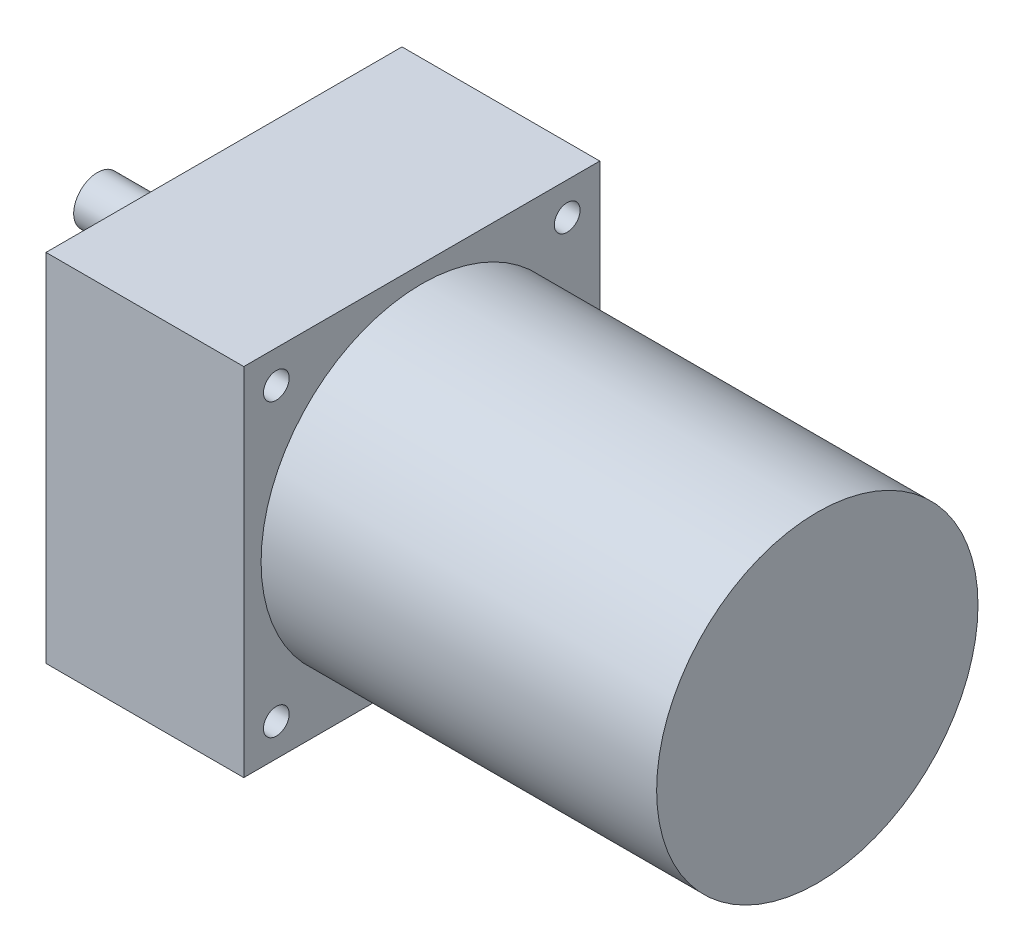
ISO-10303-21;
HEADER;
FILE_DESCRIPTION(('STEP AP214'),'2;1');
FILE_NAME('part.step','',(''),(''),'','','');
FILE_SCHEMA(('AUTOMOTIVE_DESIGN { 1 0 10303 214 1 1 1 1 }'));
ENDSEC;
DATA;
#1=APPLICATION_CONTEXT('core data for automotive mechanical design processes');
#2=APPLICATION_PROTOCOL_DEFINITION('international standard','automotive_design',2000,#1);
#3=PRODUCT_CONTEXT('',#1,'mechanical');
#4=PRODUCT('Part','Part','',(#3));
#5=PRODUCT_RELATED_PRODUCT_CATEGORY('part','',(#4));
#6=PRODUCT_DEFINITION_FORMATION('','',#4);
#7=PRODUCT_DEFINITION_CONTEXT('part definition',#1,'design');
#8=PRODUCT_DEFINITION('design','',#6,#7);
#9=PRODUCT_DEFINITION_SHAPE('','',#8);
#10=(LENGTH_UNIT() NAMED_UNIT(*) SI_UNIT(.MILLI.,.METRE.));
#11=(NAMED_UNIT(*) PLANE_ANGLE_UNIT() SI_UNIT($,.RADIAN.));
#12=(NAMED_UNIT(*) SI_UNIT($,.STERADIAN.) SOLID_ANGLE_UNIT());
#13=UNCERTAINTY_MEASURE_WITH_UNIT(LENGTH_MEASURE(1.E-05),#10,'distance_accuracy_value','');
#14=(GEOMETRIC_REPRESENTATION_CONTEXT(3) GLOBAL_UNCERTAINTY_ASSIGNED_CONTEXT((#13)) GLOBAL_UNIT_ASSIGNED_CONTEXT((#10,
#11,#12)) REPRESENTATION_CONTEXT('',''));
#15=CARTESIAN_POINT('',(0.,0.,0.));
#16=DIRECTION('',(0.,0.,1.));
#17=DIRECTION('',(1.,0.,0.));
#18=AXIS2_PLACEMENT_3D('',#15,#16,#17);
#19=CARTESIAN_POINT('',(-32.,18.,0.));
#20=DIRECTION('',(-1.,0.,0.));
#21=DIRECTION('',(0.,0.,1.));
#22=AXIS2_PLACEMENT_3D('',#19,#20,#21);
#23=PLANE('',#22);
#24=CARTESIAN_POINT('',(-32.,18.,0.));
#25=DIRECTION('',(1.,0.,0.));
#26=DIRECTION('',(0.,0.,-1.));
#27=AXIS2_PLACEMENT_3D('',#24,#25,#26);
#28=CIRCLE('',#27,6.);
#29=CARTESIAN_POINT('',(-32.,18.,-6.));
#30=VERTEX_POINT('',#29);
#31=EDGE_CURVE('E20',#30,#30,#28,.T.);
#32=ORIENTED_EDGE('',*,*,#31,.F.);
#33=EDGE_LOOP('',(#32));
#34=FACE_BOUND('',#33,.T.);
#35=ADVANCED_FACE('F17',(#34),#23,.T.);
#36=CARTESIAN_POINT('',(-32.,18.,0.));
#37=DIRECTION('',(1.,0.,0.));
#38=DIRECTION('',(0.,0.,-1.));
#39=AXIS2_PLACEMENT_3D('',#36,#37,#38);
#40=CYLINDRICAL_SURFACE('',#39,6.);
#41=CARTESIAN_POINT('',(-5.,18.,0.));
#42=DIRECTION('',(1.,0.,0.));
#43=DIRECTION('',(0.,0.,-1.));
#44=AXIS2_PLACEMENT_3D('',#41,#42,#43);
#45=CIRCLE('',#44,6.);
#46=CARTESIAN_POINT('',(-5.,18.,-6.));
#47=VERTEX_POINT('',#46);
#48=EDGE_CURVE('E117',#47,#47,#45,.T.);
#49=ORIENTED_EDGE('',*,*,#48,.F.);
#50=EDGE_LOOP('',(#49));
#51=FACE_BOUND('',#50,.T.);
#52=ORIENTED_EDGE('',*,*,#31,.T.);
#53=EDGE_LOOP('',(#52));
#54=FACE_BOUND('',#53,.T.);
#55=ADVANCED_FACE('F124',(#51,#54),#40,.T.);
#56=CARTESIAN_POINT('',(-5.,18.,0.));
#57=DIRECTION('',(-1.,0.,0.));
#58=DIRECTION('',(0.,0.,1.));
#59=AXIS2_PLACEMENT_3D('',#56,#57,#58);
#60=PLANE('',#59);
#61=ORIENTED_EDGE('',*,*,#48,.T.);
#62=EDGE_LOOP('',(#61));
#63=FACE_BOUND('',#62,.T.);
#64=CARTESIAN_POINT('',(-5.,18.,0.));
#65=DIRECTION('',(1.,0.,0.));
#66=DIRECTION('',(0.,0.,-1.));
#67=AXIS2_PLACEMENT_3D('',#64,#65,#66);
#68=CIRCLE('',#67,17.);
#69=CARTESIAN_POINT('',(-5.,18.,-17.));
#70=VERTEX_POINT('',#69);
#71=EDGE_CURVE('E115',#70,#70,#68,.T.);
#72=ORIENTED_EDGE('',*,*,#71,.F.);
#73=EDGE_LOOP('',(#72));
#74=FACE_BOUND('',#73,.T.);
#75=ADVANCED_FACE('F131',(#63,#74),#60,.T.);
#76=CARTESIAN_POINT('',(-5.,18.,0.));
#77=DIRECTION('',(1.,0.,0.));
#78=DIRECTION('',(0.,0.,-1.));
#79=AXIS2_PLACEMENT_3D('',#76,#77,#78);
#80=CYLINDRICAL_SURFACE('',#79,17.);
#81=ORIENTED_EDGE('',*,*,#71,.T.);
#82=EDGE_LOOP('',(#81));
#83=FACE_BOUND('',#82,.T.);
#84=CARTESIAN_POINT('',(0.,18.,0.));
#85=DIRECTION('',(1.,0.,0.));
#86=DIRECTION('',(0.,0.,-1.));
#87=AXIS2_PLACEMENT_3D('',#84,#85,#86);
#88=CIRCLE('',#87,17.);
#89=CARTESIAN_POINT('',(0.,18.,-17.));
#90=VERTEX_POINT('',#89);
#91=EDGE_CURVE('E112',#90,#90,#88,.F.);
#92=ORIENTED_EDGE('',*,*,#91,.T.);
#93=EDGE_LOOP('',(#92));
#94=FACE_BOUND('',#93,.T.);
#95=ADVANCED_FACE('F178',(#83,#94),#80,.T.);
#96=CARTESIAN_POINT('',(0.,0.,0.));
#97=DIRECTION('',(1.,0.,0.));
#98=DIRECTION('',(0.,0.,-1.));
#99=AXIS2_PLACEMENT_3D('',#96,#97,#98);
#100=PLANE('',#99);
#101=ORIENTED_EDGE('',*,*,#91,.F.);
#102=EDGE_LOOP('',(#101));
#103=FACE_BOUND('',#102,.T.);
#104=DIRECTION('',(0.,0.,1.));
#105=VECTOR('',#104,1.);
#106=CARTESIAN_POINT('',(0.,-45.,45.));
#107=LINE('',#106,#105);
#108=CARTESIAN_POINT('',(0.,-45.,-45.));
#109=VERTEX_POINT('',#108);
#110=CARTESIAN_POINT('',(0.,-45.,45.));
#111=VERTEX_POINT('',#110);
#112=EDGE_CURVE('E100',#109,#111,#107,.T.);
#113=ORIENTED_EDGE('',*,*,#112,.T.);
#114=DIRECTION('',(0.,1.,0.));
#115=VECTOR('',#114,1.);
#116=CARTESIAN_POINT('',(0.,45.,45.));
#117=LINE('',#116,#115);
#118=CARTESIAN_POINT('',(0.,45.,45.));
#119=VERTEX_POINT('',#118);
#120=EDGE_CURVE('E73',#111,#119,#117,.T.);
#121=ORIENTED_EDGE('',*,*,#120,.T.);
#122=DIRECTION('',(0.,0.,-1.));
#123=VECTOR('',#122,1.);
#124=CARTESIAN_POINT('',(0.,45.,45.));
#125=LINE('',#124,#123);
#126=CARTESIAN_POINT('',(0.,45.,-45.));
#127=VERTEX_POINT('',#126);
#128=EDGE_CURVE('E55',#119,#127,#125,.T.);
#129=ORIENTED_EDGE('',*,*,#128,.T.);
#130=DIRECTION('',(0.,-1.,0.));
#131=VECTOR('',#130,1.);
#132=CARTESIAN_POINT('',(0.,45.,-45.));
#133=LINE('',#132,#131);
#134=EDGE_CURVE('E60',#127,#109,#133,.T.);
#135=ORIENTED_EDGE('',*,*,#134,.T.);
#136=EDGE_LOOP('',(#113,#121,#129,#135));
#137=FACE_BOUND('',#136,.T.);
#138=CARTESIAN_POINT('',(0.,36.7695526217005,-36.7695526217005));
#139=DIRECTION('',(-1.,0.,0.));
#140=DIRECTION('',(0.,0.,1.));
#141=AXIS2_PLACEMENT_3D('',#138,#139,#140);
#142=CIRCLE('',#141,3.25);
#143=CARTESIAN_POINT('',(0.,36.7695526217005,-33.5195526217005));
#144=VERTEX_POINT('',#143);
#145=EDGE_CURVE('E69',#144,#144,#142,.F.);
#146=ORIENTED_EDGE('',*,*,#145,.T.);
#147=EDGE_LOOP('',(#146));
#148=FACE_BOUND('',#147,.T.);
#149=CARTESIAN_POINT('',(0.,-36.7695526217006,-36.7695526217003));
#150=DIRECTION('',(-1.,0.,0.));
#151=DIRECTION('',(0.,0.,1.));
#152=AXIS2_PLACEMENT_3D('',#149,#150,#151);
#153=CIRCLE('',#152,3.25);
#154=CARTESIAN_POINT('',(0.,-36.7695526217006,-33.5195526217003));
#155=VERTEX_POINT('',#154);
#156=EDGE_CURVE('E103',#155,#155,#153,.F.);
#157=ORIENTED_EDGE('',*,*,#156,.T.);
#158=EDGE_LOOP('',(#157));
#159=FACE_BOUND('',#158,.T.);
#160=CARTESIAN_POINT('',(0.,-36.7695526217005,36.7695526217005));
#161=DIRECTION('',(-1.,0.,0.));
#162=DIRECTION('',(0.,0.,1.));
#163=AXIS2_PLACEMENT_3D('',#160,#161,#162);
#164=CIRCLE('',#163,3.25);
#165=CARTESIAN_POINT('',(0.,-36.7695526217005,40.0195526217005));
#166=VERTEX_POINT('',#165);
#167=EDGE_CURVE('E106',#166,#166,#164,.F.);
#168=ORIENTED_EDGE('',*,*,#167,.T.);
#169=EDGE_LOOP('',(#168));
#170=FACE_BOUND('',#169,.T.);
#171=CARTESIAN_POINT('',(0.,36.7695526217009,36.7695526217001));
#172=DIRECTION('',(-1.,0.,0.));
#173=DIRECTION('',(0.,0.,1.));
#174=AXIS2_PLACEMENT_3D('',#171,#172,#173);
#175=CIRCLE('',#174,3.25);
#176=CARTESIAN_POINT('',(0.,36.7695526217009,40.0195526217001));
#177=VERTEX_POINT('',#176);
#178=EDGE_CURVE('E109',#177,#177,#175,.F.);
#179=ORIENTED_EDGE('',*,*,#178,.T.);
#180=EDGE_LOOP('',(#179));
#181=FACE_BOUND('',#180,.T.);
#182=ADVANCED_FACE('F71',(#103,#137,#148,#159,#170,#181),#100,.F.);
#183=CARTESIAN_POINT('',(150.,36.7695526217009,36.7695526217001));
#184=DIRECTION('',(-1.,0.,0.));
#185=DIRECTION('',(0.,0.,1.));
#186=AXIS2_PLACEMENT_3D('',#183,#184,#185);
#187=CYLINDRICAL_SURFACE('',#186,3.25);
#188=CARTESIAN_POINT('',(50.,36.7695526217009,36.7695526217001));
#189=DIRECTION('',(-1.,0.,0.));
#190=DIRECTION('',(0.,0.,1.));
#191=AXIS2_PLACEMENT_3D('',#188,#189,#190);
#192=CIRCLE('',#191,3.25);
#193=CARTESIAN_POINT('',(50.,36.7695526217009,40.0195526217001));
#194=VERTEX_POINT('',#193);
#195=EDGE_CURVE('E97',#194,#194,#192,.T.);
#196=ORIENTED_EDGE('',*,*,#195,.F.);
#197=EDGE_LOOP('',(#196));
#198=FACE_BOUND('',#197,.T.);
#199=ORIENTED_EDGE('',*,*,#178,.F.);
#200=EDGE_LOOP('',(#199));
#201=FACE_BOUND('',#200,.T.);
#202=ADVANCED_FACE('F171',(#198,#201),#187,.F.);
#203=CARTESIAN_POINT('',(150.,-36.7695526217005,36.7695526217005));
#204=DIRECTION('',(-1.,0.,0.));
#205=DIRECTION('',(0.,0.,1.));
#206=AXIS2_PLACEMENT_3D('',#203,#204,#205);
#207=CYLINDRICAL_SURFACE('',#206,3.25);
#208=CARTESIAN_POINT('',(50.,-36.7695526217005,36.7695526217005));
#209=DIRECTION('',(-1.,0.,0.));
#210=DIRECTION('',(0.,0.,1.));
#211=AXIS2_PLACEMENT_3D('',#208,#209,#210);
#212=CIRCLE('',#211,3.25);
#213=CARTESIAN_POINT('',(50.,-36.7695526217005,40.0195526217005));
#214=VERTEX_POINT('',#213);
#215=EDGE_CURVE('E94',#214,#214,#212,.T.);
#216=ORIENTED_EDGE('',*,*,#215,.F.);
#217=EDGE_LOOP('',(#216));
#218=FACE_BOUND('',#217,.T.);
#219=ORIENTED_EDGE('',*,*,#167,.F.);
#220=EDGE_LOOP('',(#219));
#221=FACE_BOUND('',#220,.T.);
#222=ADVANCED_FACE('F167',(#218,#221),#207,.F.);
#223=CARTESIAN_POINT('',(150.,-36.7695526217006,-36.7695526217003));
#224=DIRECTION('',(-1.,0.,0.));
#225=DIRECTION('',(0.,0.,1.));
#226=AXIS2_PLACEMENT_3D('',#223,#224,#225);
#227=CYLINDRICAL_SURFACE('',#226,3.25);
#228=CARTESIAN_POINT('',(50.,-36.7695526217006,-36.7695526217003));
#229=DIRECTION('',(-1.,0.,0.));
#230=DIRECTION('',(0.,0.,1.));
#231=AXIS2_PLACEMENT_3D('',#228,#229,#230);
#232=CIRCLE('',#231,3.25);
#233=CARTESIAN_POINT('',(50.,-36.7695526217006,-33.5195526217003));
#234=VERTEX_POINT('',#233);
#235=EDGE_CURVE('E91',#234,#234,#232,.T.);
#236=ORIENTED_EDGE('',*,*,#235,.F.);
#237=EDGE_LOOP('',(#236));
#238=FACE_BOUND('',#237,.T.);
#239=ORIENTED_EDGE('',*,*,#156,.F.);
#240=EDGE_LOOP('',(#239));
#241=FACE_BOUND('',#240,.T.);
#242=ADVANCED_FACE('F163',(#238,#241),#227,.F.);
#243=CARTESIAN_POINT('',(150.,36.7695526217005,-36.7695526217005));
#244=DIRECTION('',(-1.,0.,0.));
#245=DIRECTION('',(0.,0.,1.));
#246=AXIS2_PLACEMENT_3D('',#243,#244,#245);
#247=CYLINDRICAL_SURFACE('',#246,3.25);
#248=CARTESIAN_POINT('',(50.,36.7695526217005,-36.7695526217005));
#249=DIRECTION('',(-1.,0.,0.));
#250=DIRECTION('',(0.,0.,1.));
#251=AXIS2_PLACEMENT_3D('',#248,#249,#250);
#252=CIRCLE('',#251,3.25);
#253=CARTESIAN_POINT('',(50.,36.7695526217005,-33.5195526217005));
#254=VERTEX_POINT('',#253);
#255=EDGE_CURVE('E87',#254,#254,#252,.T.);
#256=ORIENTED_EDGE('',*,*,#255,.F.);
#257=EDGE_LOOP('',(#256));
#258=FACE_BOUND('',#257,.T.);
#259=ORIENTED_EDGE('',*,*,#145,.F.);
#260=EDGE_LOOP('',(#259));
#261=FACE_BOUND('',#260,.T.);
#262=ADVANCED_FACE('F160',(#258,#261),#247,.F.);
#263=CARTESIAN_POINT('',(50.,45.,-45.));
#264=DIRECTION('',(0.,0.,1.));
#265=DIRECTION('',(0.,-1.,0.));
#266=AXIS2_PLACEMENT_3D('',#263,#264,#265);
#267=PLANE('',#266);
#268=DIRECTION('',(1.,0.,0.));
#269=VECTOR('',#268,1.);
#270=CARTESIAN_POINT('',(50.,45.,-45.));
#271=LINE('',#270,#269);
#272=CARTESIAN_POINT('',(50.,45.,-45.));
#273=VERTEX_POINT('',#272);
#274=EDGE_CURVE('E62',#127,#273,#271,.T.);
#275=ORIENTED_EDGE('',*,*,#274,.T.);
#276=DIRECTION('',(0.,1.,0.));
#277=VECTOR('',#276,1.);
#278=CARTESIAN_POINT('',(50.,0.,-45.));
#279=LINE('',#278,#277);
#280=CARTESIAN_POINT('',(50.,-45.,-45.));
#281=VERTEX_POINT('',#280);
#282=EDGE_CURVE('E90',#281,#273,#279,.T.);
#283=ORIENTED_EDGE('',*,*,#282,.F.);
#284=DIRECTION('',(1.,0.,0.));
#285=VECTOR('',#284,1.);
#286=CARTESIAN_POINT('',(50.,-45.,-45.));
#287=LINE('',#286,#285);
#288=EDGE_CURVE('E65',#281,#109,#287,.F.);
#289=ORIENTED_EDGE('',*,*,#288,.T.);
#290=ORIENTED_EDGE('',*,*,#134,.F.);
#291=EDGE_LOOP('',(#275,#283,#289,#290));
#292=FACE_BOUND('',#291,.T.);
#293=ADVANCED_FACE('F61',(#292),#267,.F.);
#294=CARTESIAN_POINT('',(50.,45.,45.));
#295=DIRECTION('',(0.,-1.,0.));
#296=DIRECTION('',(0.,0.,-1.));
#297=AXIS2_PLACEMENT_3D('',#294,#295,#296);
#298=PLANE('',#297);
#299=DIRECTION('',(1.,0.,0.));
#300=VECTOR('',#299,1.);
#301=CARTESIAN_POINT('',(50.,45.,45.));
#302=LINE('',#301,#300);
#303=CARTESIAN_POINT('',(50.,45.,45.));
#304=VERTEX_POINT('',#303);
#305=EDGE_CURVE('E75',#119,#304,#302,.T.);
#306=ORIENTED_EDGE('',*,*,#305,.T.);
#307=DIRECTION('',(0.,0.,-1.));
#308=VECTOR('',#307,1.);
#309=CARTESIAN_POINT('',(50.,45.,0.));
#310=LINE('',#309,#308);
#311=EDGE_CURVE('E79',#273,#304,#310,.F.);
#312=ORIENTED_EDGE('',*,*,#311,.F.);
#313=ORIENTED_EDGE('',*,*,#274,.F.);
#314=ORIENTED_EDGE('',*,*,#128,.F.);
#315=EDGE_LOOP('',(#306,#312,#313,#314));
#316=FACE_BOUND('',#315,.T.);
#317=ADVANCED_FACE('F77',(#316),#298,.F.);
#318=CARTESIAN_POINT('',(50.,45.,45.));
#319=DIRECTION('',(0.,0.,-1.));
#320=DIRECTION('',(0.,1.,0.));
#321=AXIS2_PLACEMENT_3D('',#318,#319,#320);
#322=PLANE('',#321);
#323=DIRECTION('',(1.,0.,0.));
#324=VECTOR('',#323,1.);
#325=CARTESIAN_POINT('',(50.,-45.,45.));
#326=LINE('',#325,#324);
#327=CARTESIAN_POINT('',(50.,-45.,45.));
#328=VERTEX_POINT('',#327);
#329=EDGE_CURVE('E35',#111,#328,#326,.T.);
#330=ORIENTED_EDGE('',*,*,#329,.T.);
#331=DIRECTION('',(0.,1.,0.));
#332=VECTOR('',#331,1.);
#333=CARTESIAN_POINT('',(50.,0.,45.));
#334=LINE('',#333,#332);
#335=EDGE_CURVE('E310',#304,#328,#334,.F.);
#336=ORIENTED_EDGE('',*,*,#335,.F.);
#337=ORIENTED_EDGE('',*,*,#305,.F.);
#338=ORIENTED_EDGE('',*,*,#120,.F.);
#339=EDGE_LOOP('',(#330,#336,#337,#338));
#340=FACE_BOUND('',#339,.T.);
#341=ADVANCED_FACE('F152',(#340),#322,.F.);
#342=CARTESIAN_POINT('',(50.,-45.,45.));
#343=DIRECTION('',(0.,1.,0.));
#344=DIRECTION('',(0.,0.,1.));
#345=AXIS2_PLACEMENT_3D('',#342,#343,#344);
#346=PLANE('',#345);
#347=ORIENTED_EDGE('',*,*,#288,.F.);
#348=DIRECTION('',(0.,0.,-1.));
#349=VECTOR('',#348,1.);
#350=CARTESIAN_POINT('',(50.,-45.,0.));
#351=LINE('',#350,#349);
#352=EDGE_CURVE('E86',#328,#281,#351,.T.);
#353=ORIENTED_EDGE('',*,*,#352,.F.);
#354=ORIENTED_EDGE('',*,*,#329,.F.);
#355=ORIENTED_EDGE('',*,*,#112,.F.);
#356=EDGE_LOOP('',(#347,#353,#354,#355));
#357=FACE_BOUND('',#356,.T.);
#358=ADVANCED_FACE('F148',(#357),#346,.F.);
#359=CARTESIAN_POINT('',(150.,0.,0.));
#360=DIRECTION('',(1.,0.,0.));
#361=DIRECTION('',(0.,0.,-1.));
#362=AXIS2_PLACEMENT_3D('',#359,#360,#361);
#363=PLANE('',#362);
#364=CARTESIAN_POINT('',(150.,0.,0.));
#365=DIRECTION('',(-1.,0.,0.));
#366=DIRECTION('',(0.,0.,1.));
#367=AXIS2_PLACEMENT_3D('',#364,#365,#366);
#368=CIRCLE('',#367,40.6237943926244);
#369=CARTESIAN_POINT('',(150.,0.,40.6237943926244));
#370=VERTEX_POINT('',#369);
#371=EDGE_CURVE('E26',#370,#370,#368,.T.);
#372=ORIENTED_EDGE('',*,*,#371,.F.);
#373=EDGE_LOOP('',(#372));
#374=FACE_BOUND('',#373,.T.);
#375=ADVANCED_FACE('F141',(#374),#363,.T.);
#376=CARTESIAN_POINT('',(50.,0.,0.));
#377=DIRECTION('',(1.,0.,0.));
#378=DIRECTION('',(0.,0.,-1.));
#379=AXIS2_PLACEMENT_3D('',#376,#377,#378);
#380=PLANE('',#379);
#381=CARTESIAN_POINT('',(50.,0.,0.));
#382=DIRECTION('',(-1.,0.,0.));
#383=DIRECTION('',(0.,0.,1.));
#384=AXIS2_PLACEMENT_3D('',#381,#382,#383);
#385=CIRCLE('',#384,40.6237943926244);
#386=CARTESIAN_POINT('',(50.,0.,40.6237943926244));
#387=VERTEX_POINT('',#386);
#388=EDGE_CURVE('E11',#387,#387,#385,.F.);
#389=ORIENTED_EDGE('',*,*,#388,.F.);
#390=EDGE_LOOP('',(#389));
#391=FACE_BOUND('',#390,.T.);
#392=ORIENTED_EDGE('',*,*,#335,.T.);
#393=ORIENTED_EDGE('',*,*,#352,.T.);
#394=ORIENTED_EDGE('',*,*,#282,.T.);
#395=ORIENTED_EDGE('',*,*,#311,.T.);
#396=EDGE_LOOP('',(#392,#393,#394,#395));
#397=FACE_BOUND('',#396,.T.);
#398=ORIENTED_EDGE('',*,*,#255,.T.);
#399=EDGE_LOOP('',(#398));
#400=FACE_BOUND('',#399,.T.);
#401=ORIENTED_EDGE('',*,*,#235,.T.);
#402=EDGE_LOOP('',(#401));
#403=FACE_BOUND('',#402,.T.);
#404=ORIENTED_EDGE('',*,*,#215,.T.);
#405=EDGE_LOOP('',(#404));
#406=FACE_BOUND('',#405,.T.);
#407=ORIENTED_EDGE('',*,*,#195,.T.);
#408=EDGE_LOOP('',(#407));
#409=FACE_BOUND('',#408,.T.);
#410=ADVANCED_FACE('F135',(#391,#397,#400,#403,#406,#409),#380,.T.);
#411=CARTESIAN_POINT('',(150.,0.,0.));
#412=DIRECTION('',(-1.,0.,0.));
#413=DIRECTION('',(0.,0.,1.));
#414=AXIS2_PLACEMENT_3D('',#411,#412,#413);
#415=CYLINDRICAL_SURFACE('',#414,40.6237943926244);
#416=ORIENTED_EDGE('',*,*,#388,.T.);
#417=EDGE_LOOP('',(#416));
#418=FACE_BOUND('',#417,.T.);
#419=ORIENTED_EDGE('',*,*,#371,.T.);
#420=EDGE_LOOP('',(#419));
#421=FACE_BOUND('',#420,.T.);
#422=ADVANCED_FACE('F133',(#418,#421),#415,.T.);
#423=CLOSED_SHELL('',(#35,#55,#75,#95,#182,#202,#222,#242,#262,#293,#317,#341,#358,#375,#410,#422));
#424=MANIFOLD_SOLID_BREP('B1',#423);
#425=ADVANCED_BREP_SHAPE_REPRESENTATION('',(#18,#424),#14);
#426=SHAPE_DEFINITION_REPRESENTATION(#9,#425);
ENDSEC;
END-ISO-10303-21;
